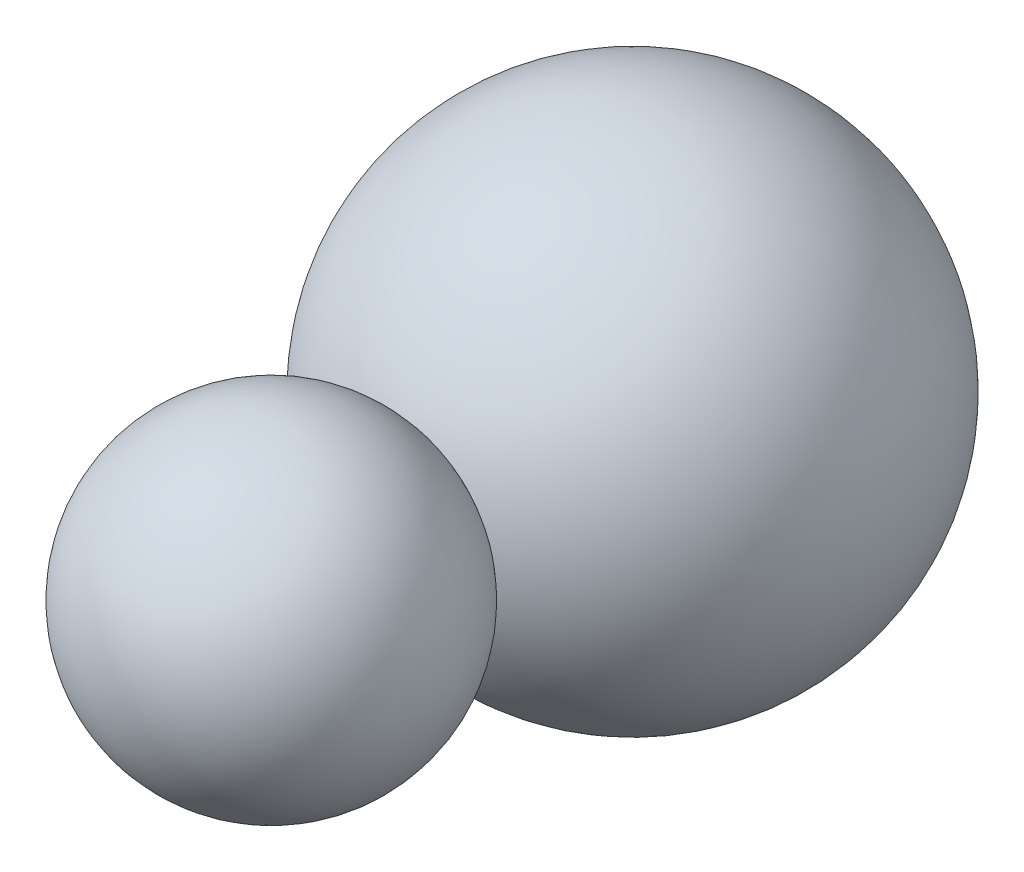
ISO-10303-21;
HEADER;
FILE_DESCRIPTION(('STEP AP214'),'2;1');
FILE_NAME('part.step','',(''),(''),'','','');
FILE_SCHEMA(('AUTOMOTIVE_DESIGN { 1 0 10303 214 1 1 1 1 }'));
ENDSEC;
DATA;
#1=APPLICATION_CONTEXT('core data for automotive mechanical design processes');
#2=APPLICATION_PROTOCOL_DEFINITION('international standard','automotive_design',2000,#1);
#3=PRODUCT_CONTEXT('',#1,'mechanical');
#4=PRODUCT('Part','Part','',(#3));
#5=PRODUCT_RELATED_PRODUCT_CATEGORY('part','',(#4));
#6=PRODUCT_DEFINITION_FORMATION('','',#4);
#7=PRODUCT_DEFINITION_CONTEXT('part definition',#1,'design');
#8=PRODUCT_DEFINITION('design','',#6,#7);
#9=PRODUCT_DEFINITION_SHAPE('','',#8);
#10=(LENGTH_UNIT() NAMED_UNIT(*) SI_UNIT(.MILLI.,.METRE.));
#11=(NAMED_UNIT(*) PLANE_ANGLE_UNIT() SI_UNIT($,.RADIAN.));
#12=(NAMED_UNIT(*) SI_UNIT($,.STERADIAN.) SOLID_ANGLE_UNIT());
#13=UNCERTAINTY_MEASURE_WITH_UNIT(LENGTH_MEASURE(1.E-05),#10,'distance_accuracy_value','');
#14=(GEOMETRIC_REPRESENTATION_CONTEXT(3) GLOBAL_UNCERTAINTY_ASSIGNED_CONTEXT((#13)) GLOBAL_UNIT_ASSIGNED_CONTEXT((#10,
#11,#12)) REPRESENTATION_CONTEXT('',''));
#15=CARTESIAN_POINT('',(0.,0.,0.));
#16=DIRECTION('',(0.,0.,1.));
#17=DIRECTION('',(1.,0.,0.));
#18=AXIS2_PLACEMENT_3D('',#15,#16,#17);
#19=CARTESIAN_POINT('',(0.,0.,0.));
#20=DIRECTION('',(0.,1.,0.));
#21=DIRECTION('',(1.,0.,0.));
#22=AXIS2_PLACEMENT_3D('',#19,#20,#21);
#23=SPHERICAL_SURFACE('',#22,23.);
#24=CARTESIAN_POINT('',(0.,0.,0.));
#25=DIRECTION('',(0.,0.,1.));
#26=DIRECTION('',(1.,0.,0.));
#27=AXIS2_PLACEMENT_3D('',#24,#25,#26);
#28=SPHERICAL_SURFACE('',#27,23.);
#29=CARTESIAN_POINT('',(0.,0.,-22.6495033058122));
#30=DIRECTION('',(0.,0.,1.));
#31=DIRECTION('',(1.,0.,0.));
#32=AXIS2_PLACEMENT_3D('',#29,#30,#31);
#33=CIRCLE('',#32,4.);
#34=CARTESIAN_POINT('',(4.,0.,-22.6495033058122));
#35=VERTEX_POINT('',#34);
#36=EDGE_CURVE('E40',#35,#35,#33,.T.);
#37=ORIENTED_EDGE('',*,*,#36,.T.);
#38=EDGE_LOOP('',(#37));
#39=FACE_BOUND('',#38,.T.);
#40=CARTESIAN_POINT('',(0.,0.,21.4705882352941));
#41=DIRECTION('',(0.,0.,1.));
#42=DIRECTION('',(1.,0.,0.));
#43=AXIS2_PLACEMENT_3D('',#40,#41,#42);
#44=CIRCLE('',#43,8.24705043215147);
#45=CARTESIAN_POINT('',(8.24705043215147,0.,21.4705882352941));
#46=VERTEX_POINT('',#45);
#47=EDGE_CURVE('E10',#46,#46,#44,.T.);
#48=ORIENTED_EDGE('',*,*,#47,.F.);
#49=EDGE_LOOP('',(#48));
#50=FACE_BOUND('',#49,.T.);
#51=ADVANCED_FACE('F34',(#39,#50),#28,.T.);
#52=CARTESIAN_POINT('',(0.,0.,-30.));
#53=DIRECTION('',(0.,0.,1.));
#54=DIRECTION('',(1.,0.,0.));
#55=AXIS2_PLACEMENT_3D('',#52,#53,#54);
#56=CYLINDRICAL_SURFACE('',#55,4.);
#57=CARTESIAN_POINT('',(0.,0.,0.));
#58=DIRECTION('',(0.,0.,1.));
#59=DIRECTION('',(1.,0.,0.));
#60=AXIS2_PLACEMENT_3D('',#57,#58,#59);
#61=CIRCLE('',#60,4.);
#62=CARTESIAN_POINT('',(4.,0.,0.));
#63=VERTEX_POINT('',#62);
#64=EDGE_CURVE('E44',#63,#63,#61,.T.);
#65=ORIENTED_EDGE('',*,*,#64,.T.);
#66=EDGE_LOOP('',(#65));
#67=FACE_BOUND('',#66,.T.);
#68=ORIENTED_EDGE('',*,*,#36,.F.);
#69=EDGE_LOOP('',(#68));
#70=FACE_BOUND('',#69,.T.);
#71=ADVANCED_FACE('F51',(#67,#70),#56,.F.);
#72=CARTESIAN_POINT('',(0.,0.,0.));
#73=DIRECTION('',(0.,0.,1.));
#74=DIRECTION('',(1.,0.,0.));
#75=AXIS2_PLACEMENT_3D('',#72,#73,#74);
#76=PLANE('',#75);
#77=ORIENTED_EDGE('',*,*,#64,.F.);
#78=EDGE_LOOP('',(#77));
#79=FACE_BOUND('',#78,.T.);
#80=ADVANCED_FACE('F54',(#79),#76,.F.);
#81=CARTESIAN_POINT('',(0.,0.,34.));
#82=DIRECTION('',(0.,0.,-1.));
#83=DIRECTION('',(1.,0.,0.));
#84=AXIS2_PLACEMENT_3D('',#81,#82,#83);
#85=SPHERICAL_SURFACE('',#84,15.);
#86=ORIENTED_EDGE('',*,*,#47,.T.);
#87=EDGE_LOOP('',(#86));
#88=FACE_BOUND('',#87,.T.);
#89=ADVANCED_FACE('F56',(#88),#85,.T.);
#90=CLOSED_SHELL('',(#51,#71,#80,#89));
#91=MANIFOLD_SOLID_BREP('B2',#90);
#92=ADVANCED_BREP_SHAPE_REPRESENTATION('',(#18,#91),#14);
#93=SHAPE_DEFINITION_REPRESENTATION(#9,#92);
ENDSEC;
END-ISO-10303-21;
